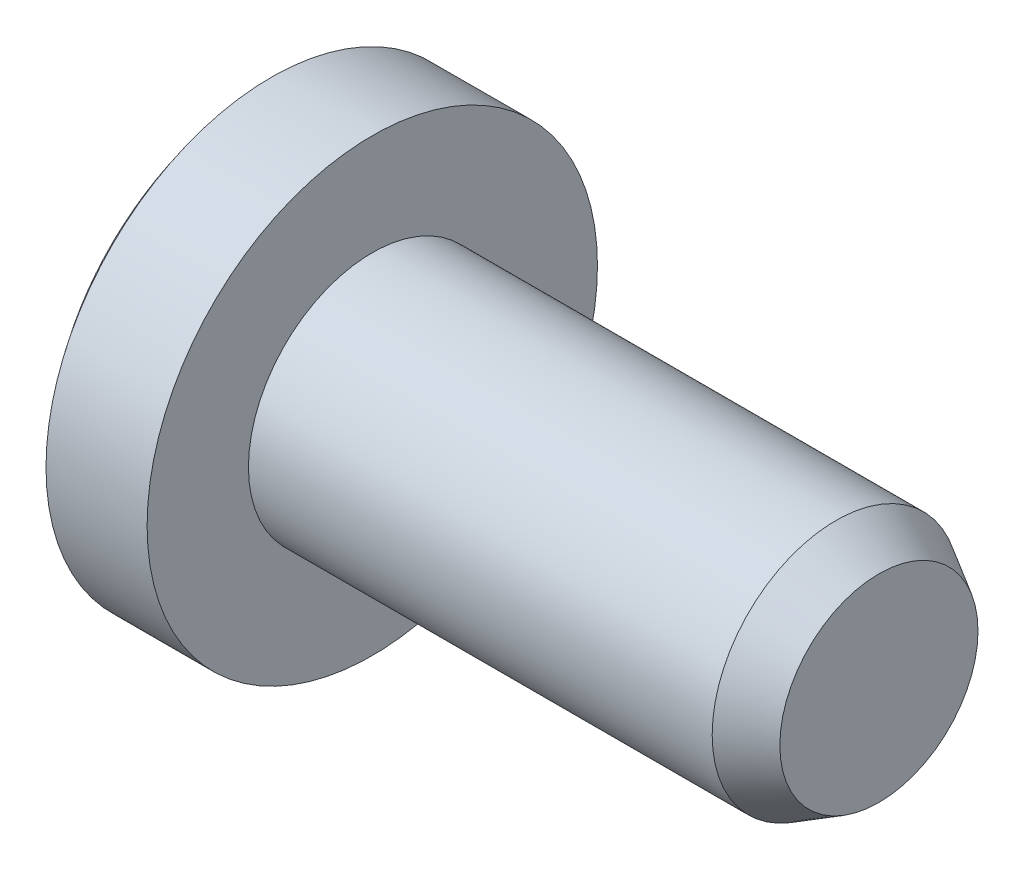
ISO-10303-21;
HEADER;
FILE_DESCRIPTION(('STEP AP214'),'2;1');
FILE_NAME('part.step','',(''),(''),'','','');
FILE_SCHEMA(('AUTOMOTIVE_DESIGN { 1 0 10303 214 1 1 1 1 }'));
ENDSEC;
DATA;
#1=APPLICATION_CONTEXT('core data for automotive mechanical design processes');
#2=APPLICATION_PROTOCOL_DEFINITION('international standard','automotive_design',2000,#1);
#3=PRODUCT_CONTEXT('',#1,'mechanical');
#4=PRODUCT('Part','Part','',(#3));
#5=PRODUCT_RELATED_PRODUCT_CATEGORY('part','',(#4));
#6=PRODUCT_DEFINITION_FORMATION('','',#4);
#7=PRODUCT_DEFINITION_CONTEXT('part definition',#1,'design');
#8=PRODUCT_DEFINITION('design','',#6,#7);
#9=PRODUCT_DEFINITION_SHAPE('','',#8);
#10=(LENGTH_UNIT() NAMED_UNIT(*) SI_UNIT(.MILLI.,.METRE.));
#11=(NAMED_UNIT(*) PLANE_ANGLE_UNIT() SI_UNIT($,.RADIAN.));
#12=(NAMED_UNIT(*) SI_UNIT($,.STERADIAN.) SOLID_ANGLE_UNIT());
#13=UNCERTAINTY_MEASURE_WITH_UNIT(LENGTH_MEASURE(1.E-05),#10,'distance_accuracy_value','');
#14=(GEOMETRIC_REPRESENTATION_CONTEXT(3) GLOBAL_UNCERTAINTY_ASSIGNED_CONTEXT((#13)) GLOBAL_UNIT_ASSIGNED_CONTEXT((#10,
#11,#12)) REPRESENTATION_CONTEXT('',''));
#15=CARTESIAN_POINT('',(0.,0.,0.));
#16=DIRECTION('',(0.,0.,1.));
#17=DIRECTION('',(1.,0.,0.));
#18=AXIS2_PLACEMENT_3D('',#15,#16,#17);
#19=CARTESIAN_POINT('',(1.6,0.,0.));
#20=DIRECTION('',(-1.,0.,0.));
#21=DIRECTION('',(0.,1.,0.));
#22=AXIS2_PLACEMENT_3D('',#19,#20,#21);
#23=SPHERICAL_SURFACE('',#22,3.2);
#24=CARTESIAN_POINT('',(-0.89799919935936,0.,0.));
#25=DIRECTION('',(-1.,0.,0.));
#26=DIRECTION('',(0.,0.,1.));
#27=AXIS2_PLACEMENT_3D('',#24,#25,#26);
#28=CIRCLE('',#27,2.);
#29=CARTESIAN_POINT('',(-0.89799919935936,0.,2.));
#30=VERTEX_POINT('',#29);
#31=EDGE_CURVE('E200',#30,#30,#28,.T.);
#32=ORIENTED_EDGE('',*,*,#31,.T.);
#33=EDGE_LOOP('',(#32));
#34=FACE_BOUND('',#33,.T.);
#35=CARTESIAN_POINT('',(1.56503616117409,0.0806815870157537,0.322726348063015));
#36=DIRECTION('',(0.104528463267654,-0.241206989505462,-0.964827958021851));
#37=DIRECTION('',(0.,0.970142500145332,-0.242535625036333));
#38=AXIS2_PLACEMENT_3D('',#35,#36,#37);
#39=CIRCLE('',#38,3.18247006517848);
#40=CARTESIAN_POINT('',(-1.45274996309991,0.934523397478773,-0.217677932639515));
#41=VERTEX_POINT('',#40);
#42=CARTESIAN_POINT('',(-1.54602165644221,0.569150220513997,-0.136439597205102));
#43=VERTEX_POINT('',#42);
#44=EDGE_CURVE('E11',#41,#43,#39,.F.);
#45=ORIENTED_EDGE('',*,*,#44,.F.);
#46=CARTESIAN_POINT('',(1.66379421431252,0.606961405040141,0.));
#47=DIRECTION('',(0.104528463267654,0.994521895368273,0.));
#48=DIRECTION('',(-0.994521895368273,0.104528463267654,0.));
#49=AXIS2_PLACEMENT_3D('',#46,#47,#48);
#50=CIRCLE('',#49,3.14126219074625);
#51=CARTESIAN_POINT('',(-1.45274996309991,0.934523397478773,0.217677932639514));
#52=VERTEX_POINT('',#51);
#53=EDGE_CURVE('E47',#52,#41,#50,.F.);
#54=ORIENTED_EDGE('',*,*,#53,.F.);
#55=CARTESIAN_POINT('',(1.56503616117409,0.0806815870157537,-0.322726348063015));
#56=DIRECTION('',(0.104528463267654,-0.241206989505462,0.964827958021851));
#57=DIRECTION('',(0.,-0.970142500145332,-0.242535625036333));
#58=AXIS2_PLACEMENT_3D('',#55,#56,#57);
#59=CIRCLE('',#58,3.18247006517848);
#60=CARTESIAN_POINT('',(-1.54602165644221,0.569150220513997,0.136439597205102));
#61=VERTEX_POINT('',#60);
#62=EDGE_CURVE('E331',#61,#52,#59,.F.);
#63=ORIENTED_EDGE('',*,*,#62,.F.);
#64=CARTESIAN_POINT('',(1.60749262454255,0.0356437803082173,0.0617368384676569));
#65=DIRECTION('',(0.104528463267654,0.497260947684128,0.861281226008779));
#66=DIRECTION('',(0.,-0.866025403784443,0.499999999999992));
#67=AXIS2_PLACEMENT_3D('',#64,#65,#66);
#68=CIRCLE('',#67,3.19919707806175);
#69=CARTESIAN_POINT('',(-1.57234339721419,0.296847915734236,0.296847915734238));
#70=VERTEX_POINT('',#69);
#71=EDGE_CURVE('E333',#70,#61,#68,.F.);
#72=ORIENTED_EDGE('',*,*,#71,.F.);
#73=CARTESIAN_POINT('',(1.60749262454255,0.0617368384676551,0.0356437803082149));
#74=DIRECTION('',(0.104528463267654,0.861281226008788,0.497260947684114));
#75=DIRECTION('',(0.,-0.499999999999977,0.866025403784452));
#76=AXIS2_PLACEMENT_3D('',#73,#74,#75);
#77=CIRCLE('',#76,3.19919707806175);
#78=CARTESIAN_POINT('',(-1.54602165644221,0.136439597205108,0.569150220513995));
#79=VERTEX_POINT('',#78);
#80=EDGE_CURVE('E329',#79,#70,#77,.F.);
#81=ORIENTED_EDGE('',*,*,#80,.F.);
#82=CARTESIAN_POINT('',(1.56503616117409,-0.322726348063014,0.0806815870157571));
#83=DIRECTION('',(0.104528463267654,0.964827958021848,-0.241206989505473));
#84=DIRECTION('',(0.,0.242535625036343,0.970142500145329));
#85=AXIS2_PLACEMENT_3D('',#82,#83,#84);
#86=CIRCLE('',#85,3.18247006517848);
#87=CARTESIAN_POINT('',(-1.45274996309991,0.217677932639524,0.934523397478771));
#88=VERTEX_POINT('',#87);
#89=EDGE_CURVE('E330',#88,#79,#86,.F.);
#90=ORIENTED_EDGE('',*,*,#89,.F.);
#91=CARTESIAN_POINT('',(1.66379421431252,0.,0.606961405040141));
#92=DIRECTION('',(0.104528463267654,0.,0.994521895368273));
#93=DIRECTION('',(0.994521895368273,0.,-0.104528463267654));
#94=AXIS2_PLACEMENT_3D('',#91,#92,#93);
#95=CIRCLE('',#94,3.14126219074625);
#96=CARTESIAN_POINT('',(-1.45274996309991,-0.217677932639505,0.934523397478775));
#97=VERTEX_POINT('',#96);
#98=EDGE_CURVE('E324',#97,#88,#95,.F.);
#99=ORIENTED_EDGE('',*,*,#98,.F.);
#100=CARTESIAN_POINT('',(1.56503616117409,0.322726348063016,0.0806815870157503));
#101=DIRECTION('',(0.104528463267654,-0.964827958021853,-0.241206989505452));
#102=DIRECTION('',(0.,0.242535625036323,-0.970142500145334));
#103=AXIS2_PLACEMENT_3D('',#100,#101,#102);
#104=CIRCLE('',#103,3.18247006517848);
#105=CARTESIAN_POINT('',(-1.54602165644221,-0.136439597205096,0.569150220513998));
#106=VERTEX_POINT('',#105);
#107=EDGE_CURVE('E322',#106,#97,#104,.F.);
#108=ORIENTED_EDGE('',*,*,#107,.F.);
#109=CARTESIAN_POINT('',(1.60749262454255,-0.0617368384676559,0.0356437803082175));
#110=DIRECTION('',(0.104528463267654,-0.861281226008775,0.497260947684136));
#111=DIRECTION('',(0.,-0.499999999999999,-0.866025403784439));
#112=AXIS2_PLACEMENT_3D('',#109,#110,#111);
#113=CIRCLE('',#112,3.19919707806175);
#114=CARTESIAN_POINT('',(-1.57234339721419,-0.296847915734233,0.296847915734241));
#115=VERTEX_POINT('',#114);
#116=EDGE_CURVE('E321',#115,#106,#113,.F.);
#117=ORIENTED_EDGE('',*,*,#116,.F.);
#118=CARTESIAN_POINT('',(1.60749262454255,-0.035643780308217,0.0617368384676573));
#119=DIRECTION('',(0.104528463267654,-0.497260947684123,0.861281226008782));
#120=DIRECTION('',(0.,-0.866025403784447,-0.499999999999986));
#121=AXIS2_PLACEMENT_3D('',#118,#119,#120);
#122=CIRCLE('',#121,3.19919707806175);
#123=CARTESIAN_POINT('',(-1.54602165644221,-0.569150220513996,0.136439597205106));
#124=VERTEX_POINT('',#123);
#125=EDGE_CURVE('E316',#124,#115,#122,.F.);
#126=ORIENTED_EDGE('',*,*,#125,.F.);
#127=CARTESIAN_POINT('',(1.56503616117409,-0.0806815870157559,-0.322726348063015));
#128=DIRECTION('',(0.104528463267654,0.241206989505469,0.964827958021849));
#129=DIRECTION('',(0.,-0.97014250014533,0.242535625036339));
#130=AXIS2_PLACEMENT_3D('',#127,#128,#129);
#131=CIRCLE('',#130,3.18247006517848);
#132=CARTESIAN_POINT('',(-1.45274996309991,-0.934523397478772,0.217677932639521));
#133=VERTEX_POINT('',#132);
#134=EDGE_CURVE('E320',#133,#124,#131,.F.);
#135=ORIENTED_EDGE('',*,*,#134,.F.);
#136=CARTESIAN_POINT('',(1.66379421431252,-0.606961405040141,0.));
#137=DIRECTION('',(0.104528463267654,-0.994521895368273,0.));
#138=DIRECTION('',(0.994521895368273,0.104528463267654,0.));
#139=AXIS2_PLACEMENT_3D('',#136,#137,#138);
#140=CIRCLE('',#139,3.14126219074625);
#141=CARTESIAN_POINT('',(-1.45274996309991,-0.934523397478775,-0.217677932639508));
#142=VERTEX_POINT('',#141);
#143=EDGE_CURVE('E314',#142,#133,#140,.F.);
#144=ORIENTED_EDGE('',*,*,#143,.F.);
#145=CARTESIAN_POINT('',(1.56503616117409,-0.0806815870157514,0.322726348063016));
#146=DIRECTION('',(0.104528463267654,0.241206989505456,-0.964827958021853));
#147=DIRECTION('',(0.,0.970142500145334,0.242535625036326));
#148=AXIS2_PLACEMENT_3D('',#145,#146,#147);
#149=CIRCLE('',#148,3.18247006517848);
#150=CARTESIAN_POINT('',(-1.54602165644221,-0.569150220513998,-0.136439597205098));
#151=VERTEX_POINT('',#150);
#152=EDGE_CURVE('E312',#151,#142,#149,.F.);
#153=ORIENTED_EDGE('',*,*,#152,.F.);
#154=CARTESIAN_POINT('',(1.60749262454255,-0.0356437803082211,-0.0617368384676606));
#155=DIRECTION('',(0.104528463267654,-0.497260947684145,-0.861281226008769));
#156=DIRECTION('',(0.,0.866025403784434,-0.500000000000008));
#157=AXIS2_PLACEMENT_3D('',#154,#155,#156);
#158=CIRCLE('',#157,3.19919707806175);
#159=CARTESIAN_POINT('',(-1.57234339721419,-0.296847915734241,-0.296847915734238));
#160=VERTEX_POINT('',#159);
#161=EDGE_CURVE('E311',#160,#151,#158,.F.);
#162=ORIENTED_EDGE('',*,*,#161,.F.);
#163=CARTESIAN_POINT('',(1.60749262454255,-0.061736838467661,-0.0356437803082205));
#164=DIRECTION('',(0.104528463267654,-0.861281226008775,-0.497260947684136));
#165=DIRECTION('',(0.,0.499999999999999,-0.866025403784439));
#166=AXIS2_PLACEMENT_3D('',#163,#164,#165);
#167=CIRCLE('',#166,3.19919707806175);
#168=CARTESIAN_POINT('',(-1.54602165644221,-0.136439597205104,-0.569150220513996));
#169=VERTEX_POINT('',#168);
#170=EDGE_CURVE('E307',#169,#160,#167,.F.);
#171=ORIENTED_EDGE('',*,*,#170,.F.);
#172=CARTESIAN_POINT('',(1.56503616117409,0.322726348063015,-0.0806815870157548));
#173=DIRECTION('',(0.104528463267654,-0.96482795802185,0.241206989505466));
#174=DIRECTION('',(0.,-0.242535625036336,-0.970142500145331));
#175=AXIS2_PLACEMENT_3D('',#172,#173,#174);
#176=CIRCLE('',#175,3.18247006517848);
#177=CARTESIAN_POINT('',(-1.45274996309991,-0.217677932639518,-0.934523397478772));
#178=VERTEX_POINT('',#177);
#179=EDGE_CURVE('E310',#178,#169,#176,.F.);
#180=ORIENTED_EDGE('',*,*,#179,.F.);
#181=CARTESIAN_POINT('',(1.66379421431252,0.,-0.606961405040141));
#182=DIRECTION('',(0.104528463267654,0.,-0.994521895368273));
#183=DIRECTION('',(-0.994521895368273,0.,-0.104528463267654));
#184=AXIS2_PLACEMENT_3D('',#181,#182,#183);
#185=CIRCLE('',#184,3.14126219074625);
#186=CARTESIAN_POINT('',(-1.45274996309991,0.217677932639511,-0.934523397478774));
#187=VERTEX_POINT('',#186);
#188=EDGE_CURVE('E304',#187,#178,#185,.F.);
#189=ORIENTED_EDGE('',*,*,#188,.F.);
#190=CARTESIAN_POINT('',(1.56503616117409,-0.322726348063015,-0.0806815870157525));
#191=DIRECTION('',(0.104528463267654,0.964827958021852,0.241206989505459));
#192=DIRECTION('',(0.,-0.242535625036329,0.970142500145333));
#193=AXIS2_PLACEMENT_3D('',#190,#191,#192);
#194=CIRCLE('',#193,3.18247006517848);
#195=CARTESIAN_POINT('',(-1.54602165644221,0.1364395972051,-0.569150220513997));
#196=VERTEX_POINT('',#195);
#197=EDGE_CURVE('E303',#196,#187,#194,.F.);
#198=ORIENTED_EDGE('',*,*,#197,.F.);
#199=CARTESIAN_POINT('',(1.60749262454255,0.0617368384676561,-0.035643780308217));
#200=DIRECTION('',(0.104528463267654,0.861281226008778,-0.497260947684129));
#201=DIRECTION('',(0.,0.499999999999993,0.866025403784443));
#202=AXIS2_PLACEMENT_3D('',#199,#200,#201);
#203=CIRCLE('',#202,3.19919707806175);
#204=CARTESIAN_POINT('',(-1.57234339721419,0.296847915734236,-0.296847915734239));
#205=VERTEX_POINT('',#204);
#206=EDGE_CURVE('E301',#205,#196,#203,.F.);
#207=ORIENTED_EDGE('',*,*,#206,.F.);
#208=CARTESIAN_POINT('',(1.60749262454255,0.0356437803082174,-0.061736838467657));
#209=DIRECTION('',(0.104528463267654,0.497260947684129,-0.861281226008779));
#210=DIRECTION('',(0.,0.866025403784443,0.499999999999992));
#211=AXIS2_PLACEMENT_3D('',#208,#209,#210);
#212=CIRCLE('',#211,3.19919707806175);
#213=EDGE_CURVE('E299',#43,#205,#212,.F.);
#214=ORIENTED_EDGE('',*,*,#213,.F.);
#215=EDGE_LOOP('',(#45,#54,#63,#72,#81,#90,#99,#108,#117,#126,#135,#144,#153,#162,#171,#180,
#189,#198,#207,#214));
#216=FACE_BOUND('',#215,.T.);
#217=ADVANCED_FACE('F41',(#34,#216),#23,.T.);
#218=CARTESIAN_POINT('',(0.,1.1,0.));
#219=DIRECTION('',(-1.,0.,0.));
#220=DIRECTION('',(0.,0.,1.));
#221=AXIS2_PLACEMENT_3D('',#218,#219,#220);
#222=PLANE('',#221);
#223=CARTESIAN_POINT('',(0.,0.,0.));
#224=DIRECTION('',(-1.,0.,0.));
#225=DIRECTION('',(0.,0.,1.));
#226=AXIS2_PLACEMENT_3D('',#223,#224,#225);
#227=CIRCLE('',#226,2.);
#228=CARTESIAN_POINT('',(0.,0.,2.));
#229=VERTEX_POINT('',#228);
#230=EDGE_CURVE('E289',#229,#229,#227,.T.);
#231=ORIENTED_EDGE('',*,*,#230,.F.);
#232=EDGE_LOOP('',(#231));
#233=FACE_BOUND('',#232,.T.);
#234=CARTESIAN_POINT('',(0.,0.,0.));
#235=DIRECTION('',(-1.,0.,0.));
#236=DIRECTION('',(0.,0.,1.));
#237=AXIS2_PLACEMENT_3D('',#234,#235,#236);
#238=CIRCLE('',#237,1.1);
#239=CARTESIAN_POINT('',(0.,0.,1.1));
#240=VERTEX_POINT('',#239);
#241=EDGE_CURVE('E192',#240,#240,#238,.T.);
#242=ORIENTED_EDGE('',*,*,#241,.T.);
#243=EDGE_LOOP('',(#242));
#244=FACE_BOUND('',#243,.T.);
#245=ADVANCED_FACE('F429',(#233,#244),#222,.F.);
#246=CARTESIAN_POINT('',(0.,0.,0.));
#247=DIRECTION('',(-1.,0.,0.));
#248=DIRECTION('',(0.,0.,1.));
#249=AXIS2_PLACEMENT_3D('',#246,#247,#248);
#250=CYLINDRICAL_SURFACE('',#249,2.);
#251=ORIENTED_EDGE('',*,*,#31,.F.);
#252=EDGE_LOOP('',(#251));
#253=FACE_BOUND('',#252,.T.);
#254=ORIENTED_EDGE('',*,*,#230,.T.);
#255=EDGE_LOOP('',(#254));
#256=FACE_BOUND('',#255,.T.);
#257=ADVANCED_FACE('F440',(#253,#256),#250,.T.);
#258=CARTESIAN_POINT('',(4.5,1.1,0.));
#259=DIRECTION('',(-1.,0.,0.));
#260=DIRECTION('',(0.,0.,1.));
#261=AXIS2_PLACEMENT_3D('',#258,#259,#260);
#262=PLANE('',#261);
#263=CARTESIAN_POINT('',(4.5,0.,0.));
#264=DIRECTION('',(-1.,0.,0.));
#265=DIRECTION('',(0.,0.,1.));
#266=AXIS2_PLACEMENT_3D('',#263,#264,#265);
#267=CIRCLE('',#266,0.88);
#268=CARTESIAN_POINT('',(4.5,0.,0.88));
#269=VERTEX_POINT('',#268);
#270=EDGE_CURVE('E298',#269,#269,#267,.F.);
#271=ORIENTED_EDGE('',*,*,#270,.T.);
#272=EDGE_LOOP('',(#271));
#273=FACE_BOUND('',#272,.T.);
#274=ADVANCED_FACE('F441',(#273),#262,.F.);
#275=CARTESIAN_POINT('',(0.,0.,0.));
#276=DIRECTION('',(-1.,0.,0.));
#277=DIRECTION('',(0.,0.,1.));
#278=AXIS2_PLACEMENT_3D('',#275,#276,#277);
#279=CYLINDRICAL_SURFACE('',#278,1.1);
#280=CARTESIAN_POINT('',(4.11894882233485,0.,0.));
#281=DIRECTION('',(-1.,0.,0.));
#282=DIRECTION('',(0.,0.,1.));
#283=AXIS2_PLACEMENT_3D('',#280,#281,#282);
#284=CIRCLE('',#283,1.1);
#285=CARTESIAN_POINT('',(4.11894882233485,0.,1.1));
#286=VERTEX_POINT('',#285);
#287=EDGE_CURVE('E291',#286,#286,#284,.T.);
#288=ORIENTED_EDGE('',*,*,#287,.T.);
#289=EDGE_LOOP('',(#288));
#290=FACE_BOUND('',#289,.T.);
#291=ORIENTED_EDGE('',*,*,#241,.F.);
#292=EDGE_LOOP('',(#291));
#293=FACE_BOUND('',#292,.T.);
#294=ADVANCED_FACE('F449',(#290,#293),#279,.T.);
#295=CARTESIAN_POINT('',(4.11894882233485,0.,0.));
#296=DIRECTION('',(-1.,0.,0.));
#297=DIRECTION('',(0.,0.,1.));
#298=AXIS2_PLACEMENT_3D('',#295,#296,#297);
#299=CONICAL_SURFACE('',#298,1.1,0.523598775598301);
#300=ORIENTED_EDGE('',*,*,#270,.F.);
#301=EDGE_LOOP('',(#300));
#302=FACE_BOUND('',#301,.T.);
#303=ORIENTED_EDGE('',*,*,#287,.F.);
#304=EDGE_LOOP('',(#303));
#305=FACE_BOUND('',#304,.T.);
#306=ADVANCED_FACE('F43',(#302,#305),#299,.T.);
#307=CARTESIAN_POINT('',(-1.6,0.95,-0.2375));
#308=DIRECTION('',(0.104528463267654,-0.241206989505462,-0.964827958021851));
#309=DIRECTION('',(0.,0.970142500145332,-0.242535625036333));
#310=AXIS2_PLACEMENT_3D('',#307,#308,#309);
#311=PLANE('',#310);
#312=ORIENTED_EDGE('',*,*,#44,.T.);
#313=DIRECTION('',(-0.993634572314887,0.0156427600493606,-0.111560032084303));
#314=VECTOR('',#313,1.);
#315=CARTESIAN_POINT('',(-1.6,0.57,-0.1425));
#316=LINE('',#315,#314);
#317=CARTESIAN_POINT('',(-0.8,0.557405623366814,-0.052680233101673));
#318=VERTEX_POINT('',#317);
#319=EDGE_CURVE('E57',#318,#43,#316,.T.);
#320=ORIENTED_EDGE('',*,*,#319,.F.);
#321=DIRECTION('',(0.,-0.970142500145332,0.242535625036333));
#322=VECTOR('',#321,1.);
#323=CARTESIAN_POINT('',(-0.8,0.0203932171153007,0.081572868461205));
#324=LINE('',#323,#322);
#325=CARTESIAN_POINT('',(-0.8,0.865916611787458,-0.129807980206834));
#326=VERTEX_POINT('',#325);
#327=EDGE_CURVE('E185',#318,#326,#324,.F.);
#328=ORIENTED_EDGE('',*,*,#327,.T.);
#329=DIRECTION('',(-0.985727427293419,0.103604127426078,-0.132693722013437));
#330=VECTOR('',#329,1.);
#331=CARTESIAN_POINT('',(-1.53787007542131,0.943469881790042,-0.229136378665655));
#332=LINE('',#331,#330);
#333=EDGE_CURVE('E186',#326,#41,#332,.T.);
#334=ORIENTED_EDGE('',*,*,#333,.T.);
#335=EDGE_LOOP('',(#312,#320,#328,#334));
#336=FACE_BOUND('',#335,.T.);
#337=ADVANCED_FACE('F189',(#336),#311,.F.);
#338=CARTESIAN_POINT('',(-1.6,0.95,0.2375));
#339=DIRECTION('',(0.104528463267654,0.994521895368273,0.));
#340=DIRECTION('',(-0.994521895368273,0.104528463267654,0.));
#341=AXIS2_PLACEMENT_3D('',#338,#339,#340);
#342=PLANE('',#341);
#343=ORIENTED_EDGE('',*,*,#53,.T.);
#344=ORIENTED_EDGE('',*,*,#333,.F.);
#345=DIRECTION('',(0.,0.,-1.));
#346=VECTOR('',#345,1.);
#347=CARTESIAN_POINT('',(-0.8,0.865916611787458,0.));
#348=LINE('',#347,#346);
#349=CARTESIAN_POINT('',(-0.8,0.865916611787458,0.129807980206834));
#350=VERTEX_POINT('',#349);
#351=EDGE_CURVE('E178',#326,#350,#348,.F.);
#352=ORIENTED_EDGE('',*,*,#351,.T.);
#353=DIRECTION('',(-0.985727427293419,0.103604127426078,0.132693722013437));
#354=VECTOR('',#353,1.);
#355=CARTESIAN_POINT('',(-1.6,0.95,0.2375));
#356=LINE('',#355,#354);
#357=EDGE_CURVE('E193',#350,#52,#356,.T.);
#358=ORIENTED_EDGE('',*,*,#357,.T.);
#359=EDGE_LOOP('',(#343,#344,#352,#358));
#360=FACE_BOUND('',#359,.T.);
#361=ADVANCED_FACE('F195',(#360),#342,.F.);
#362=CARTESIAN_POINT('',(-1.6,0.95,0.2375));
#363=DIRECTION('',(0.104528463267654,-0.241206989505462,0.964827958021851));
#364=DIRECTION('',(0.,-0.970142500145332,-0.242535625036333));
#365=AXIS2_PLACEMENT_3D('',#362,#363,#364);
#366=PLANE('',#365);
#367=ORIENTED_EDGE('',*,*,#62,.T.);
#368=ORIENTED_EDGE('',*,*,#357,.F.);
#369=DIRECTION('',(0.,0.970142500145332,0.242535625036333));
#370=VECTOR('',#369,1.);
#371=CARTESIAN_POINT('',(-0.8,0.0203932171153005,-0.0815728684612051));
#372=LINE('',#371,#370);
#373=CARTESIAN_POINT('',(-0.8,0.557405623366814,0.052680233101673));
#374=VERTEX_POINT('',#373);
#375=EDGE_CURVE('E183',#350,#374,#372,.F.);
#376=ORIENTED_EDGE('',*,*,#375,.T.);
#377=DIRECTION('',(-0.993634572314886,0.0156427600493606,0.111560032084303));
#378=VECTOR('',#377,1.);
#379=CARTESIAN_POINT('',(-1.61643715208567,0.57025876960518,0.14434547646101));
#380=LINE('',#379,#378);
#381=EDGE_CURVE('E199',#374,#61,#380,.T.);
#382=ORIENTED_EDGE('',*,*,#381,.T.);
#383=EDGE_LOOP('',(#367,#368,#376,#382));
#384=FACE_BOUND('',#383,.T.);
#385=ADVANCED_FACE('F337',(#384),#366,.F.);
#386=CARTESIAN_POINT('',(-1.6,0.57,0.1425));
#387=DIRECTION('',(0.104528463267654,0.497260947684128,0.861281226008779));
#388=DIRECTION('',(0.,-0.866025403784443,0.499999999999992));
#389=AXIS2_PLACEMENT_3D('',#386,#387,#388);
#390=PLANE('',#389);
#391=ORIENTED_EDGE('',*,*,#71,.T.);
#392=ORIENTED_EDGE('',*,*,#381,.F.);
#393=DIRECTION('',(0.,0.866025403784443,-0.499999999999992));
#394=VECTOR('',#393,1.);
#395=CARTESIAN_POINT('',(-0.8,0.162162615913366,0.280873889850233));
#396=LINE('',#395,#394);
#397=CARTESIAN_POINT('',(-0.8,0.237422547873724,0.237422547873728));
#398=VERTEX_POINT('',#397);
#399=EDGE_CURVE('E253',#374,#398,#396,.F.);
#400=ORIENTED_EDGE('',*,*,#399,.T.);
#401=DIRECTION('',(-0.994132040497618,0.0764901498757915,0.0764901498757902));
#402=VECTOR('',#401,1.);
#403=CARTESIAN_POINT('',(-1.60871040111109,0.299646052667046,0.299646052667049));
#404=LINE('',#403,#402);
#405=EDGE_CURVE('E248',#398,#70,#404,.T.);
#406=ORIENTED_EDGE('',*,*,#405,.T.);
#407=EDGE_LOOP('',(#391,#392,#400,#406));
#408=FACE_BOUND('',#407,.T.);
#409=ADVANCED_FACE('F417',(#408),#390,.F.);
#410=CARTESIAN_POINT('',(-1.6,0.142500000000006,0.569999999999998));
#411=DIRECTION('',(0.104528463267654,0.861281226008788,0.497260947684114));
#412=DIRECTION('',(0.,-0.499999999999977,0.866025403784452));
#413=AXIS2_PLACEMENT_3D('',#410,#411,#412);
#414=PLANE('',#413);
#415=ORIENTED_EDGE('',*,*,#80,.T.);
#416=ORIENTED_EDGE('',*,*,#405,.F.);
#417=DIRECTION('',(0.,0.499999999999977,-0.866025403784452));
#418=VECTOR('',#417,1.);
#419=CARTESIAN_POINT('',(-0.8,0.280873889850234,0.162162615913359));
#420=LINE('',#419,#418);
#421=CARTESIAN_POINT('',(-0.8,0.0526802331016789,0.557405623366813));
#422=VERTEX_POINT('',#421);
#423=EDGE_CURVE('E260',#398,#422,#420,.F.);
#424=ORIENTED_EDGE('',*,*,#423,.T.);
#425=DIRECTION('',(-0.993634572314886,0.111560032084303,0.0156427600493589));
#426=VECTOR('',#425,1.);
#427=CARTESIAN_POINT('',(-1.6,0.142500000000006,0.569999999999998));
#428=LINE('',#427,#426);
#429=EDGE_CURVE('E246',#422,#79,#428,.T.);
#430=ORIENTED_EDGE('',*,*,#429,.T.);
#431=EDGE_LOOP('',(#415,#416,#424,#430));
#432=FACE_BOUND('',#431,.T.);
#433=ADVANCED_FACE('F418',(#432),#414,.F.);
#434=CARTESIAN_POINT('',(-1.6,0.23750000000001,0.949999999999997));
#435=DIRECTION('',(0.104528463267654,0.964827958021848,-0.241206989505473));
#436=DIRECTION('',(0.,0.242535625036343,0.970142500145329));
#437=AXIS2_PLACEMENT_3D('',#434,#435,#436);
#438=PLANE('',#437);
#439=ORIENTED_EDGE('',*,*,#89,.T.);
#440=ORIENTED_EDGE('',*,*,#429,.F.);
#441=DIRECTION('',(0.,-0.242535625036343,-0.970142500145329));
#442=VECTOR('',#441,1.);
#443=CARTESIAN_POINT('',(-0.8,-0.0815728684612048,0.0203932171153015));
#444=LINE('',#443,#442);
#445=CARTESIAN_POINT('',(-0.8,0.129807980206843,0.865916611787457));
#446=VERTEX_POINT('',#445);
#447=EDGE_CURVE('E258',#422,#446,#444,.F.);
#448=ORIENTED_EDGE('',*,*,#447,.T.);
#449=DIRECTION('',(-0.985727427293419,0.132693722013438,0.103604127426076));
#450=VECTOR('',#449,1.);
#451=CARTESIAN_POINT('',(-1.53787007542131,0.229136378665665,0.94346988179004));
#452=LINE('',#451,#450);
#453=EDGE_CURVE('E243',#446,#88,#452,.T.);
#454=ORIENTED_EDGE('',*,*,#453,.T.);
#455=EDGE_LOOP('',(#439,#440,#448,#454));
#456=FACE_BOUND('',#455,.T.);
#457=ADVANCED_FACE('F413',(#456),#438,.F.);
#458=CARTESIAN_POINT('',(-1.6,-0.23749999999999,0.950000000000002));
#459=DIRECTION('',(0.104528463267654,0.,0.994521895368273));
#460=DIRECTION('',(0.994521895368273,0.,-0.104528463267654));
#461=AXIS2_PLACEMENT_3D('',#458,#459,#460);
#462=PLANE('',#461);
#463=ORIENTED_EDGE('',*,*,#98,.T.);
#464=ORIENTED_EDGE('',*,*,#453,.F.);
#465=DIRECTION('',(0.,1.,0.));
#466=VECTOR('',#465,1.);
#467=CARTESIAN_POINT('',(-0.8,0.,0.865916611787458));
#468=LINE('',#467,#466);
#469=CARTESIAN_POINT('',(-0.8,-0.129807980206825,0.86591661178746));
#470=VERTEX_POINT('',#469);
#471=EDGE_CURVE('E262',#446,#470,#468,.F.);
#472=ORIENTED_EDGE('',*,*,#471,.T.);
#473=DIRECTION('',(-0.985727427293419,-0.132693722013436,0.103604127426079));
#474=VECTOR('',#473,1.);
#475=CARTESIAN_POINT('',(-1.6,-0.23749999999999,0.950000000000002));
#476=LINE('',#475,#474);
#477=EDGE_CURVE('E239',#470,#97,#476,.T.);
#478=ORIENTED_EDGE('',*,*,#477,.T.);
#479=EDGE_LOOP('',(#463,#464,#472,#478));
#480=FACE_BOUND('',#479,.T.);
#481=ADVANCED_FACE('F406',(#480),#462,.F.);
#482=CARTESIAN_POINT('',(-1.6,-0.23749999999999,0.950000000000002));
#483=DIRECTION('',(0.104528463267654,-0.964827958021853,-0.241206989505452));
#484=DIRECTION('',(0.,0.242535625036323,-0.970142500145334));
#485=AXIS2_PLACEMENT_3D('',#482,#483,#484);
#486=PLANE('',#485);
#487=ORIENTED_EDGE('',*,*,#107,.T.);
#488=ORIENTED_EDGE('',*,*,#477,.F.);
#489=DIRECTION('',(0.,-0.242535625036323,0.970142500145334));
#490=VECTOR('',#489,1.);
#491=CARTESIAN_POINT('',(-0.8,0.0815728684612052,0.0203932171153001));
#492=LINE('',#491,#490);
#493=CARTESIAN_POINT('',(-0.8,-0.0526802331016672,0.557405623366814));
#494=VERTEX_POINT('',#493);
#495=EDGE_CURVE('E263',#470,#494,#492,.F.);
#496=ORIENTED_EDGE('',*,*,#495,.T.);
#497=DIRECTION('',(-0.993634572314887,-0.111560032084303,0.0156427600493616));
#498=VECTOR('',#497,1.);
#499=CARTESIAN_POINT('',(-1.61643715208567,-0.144345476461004,0.570258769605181));
#500=LINE('',#499,#498);
#501=EDGE_CURVE('E240',#494,#106,#500,.T.);
#502=ORIENTED_EDGE('',*,*,#501,.T.);
#503=EDGE_LOOP('',(#487,#488,#496,#502));
#504=FACE_BOUND('',#503,.T.);
#505=ADVANCED_FACE('F404',(#504),#486,.F.);
#506=CARTESIAN_POINT('',(-1.6,-0.142499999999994,0.570000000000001));
#507=DIRECTION('',(0.104528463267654,-0.861281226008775,0.497260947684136));
#508=DIRECTION('',(0.,-0.499999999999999,-0.866025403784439));
#509=AXIS2_PLACEMENT_3D('',#506,#507,#508);
#510=PLANE('',#509);
#511=ORIENTED_EDGE('',*,*,#116,.T.);
#512=ORIENTED_EDGE('',*,*,#501,.F.);
#513=DIRECTION('',(0.,0.499999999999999,0.866025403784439));
#514=VECTOR('',#513,1.);
#515=CARTESIAN_POINT('',(-0.8,-0.280873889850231,0.162162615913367));
#516=LINE('',#515,#514);
#517=CARTESIAN_POINT('',(-0.8,-0.237422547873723,0.23742254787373));
#518=VERTEX_POINT('',#517);
#519=EDGE_CURVE('E261',#494,#518,#516,.F.);
#520=ORIENTED_EDGE('',*,*,#519,.T.);
#521=DIRECTION('',(-0.994132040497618,-0.07649014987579,0.0764901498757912));
#522=VECTOR('',#521,1.);
#523=CARTESIAN_POINT('',(-1.60871040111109,-0.299646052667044,0.299646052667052));
#524=LINE('',#523,#522);
#525=EDGE_CURVE('E234',#518,#115,#524,.T.);
#526=ORIENTED_EDGE('',*,*,#525,.T.);
#527=EDGE_LOOP('',(#511,#512,#520,#526));
#528=FACE_BOUND('',#527,.T.);
#529=ADVANCED_FACE('F400',(#528),#510,.F.);
#530=CARTESIAN_POINT('',(-1.6,-0.569999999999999,0.142500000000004));
#531=DIRECTION('',(0.104528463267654,-0.497260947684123,0.861281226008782));
#532=DIRECTION('',(0.,-0.866025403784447,-0.499999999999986));
#533=AXIS2_PLACEMENT_3D('',#530,#531,#532);
#534=PLANE('',#533);
#535=ORIENTED_EDGE('',*,*,#125,.T.);
#536=ORIENTED_EDGE('',*,*,#525,.F.);
#537=DIRECTION('',(0.,0.866025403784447,0.499999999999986));
#538=VECTOR('',#537,1.);
#539=CARTESIAN_POINT('',(-0.8,-0.162162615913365,0.280873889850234));
#540=LINE('',#539,#538);
#541=CARTESIAN_POINT('',(-0.8,-0.557405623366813,0.0526802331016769));
#542=VERTEX_POINT('',#541);
#543=EDGE_CURVE('E270',#518,#542,#540,.F.);
#544=ORIENTED_EDGE('',*,*,#543,.T.);
#545=DIRECTION('',(-0.993634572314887,-0.0156427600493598,0.111560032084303));
#546=VECTOR('',#545,1.);
#547=CARTESIAN_POINT('',(-1.6,-0.569999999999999,0.142500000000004));
#548=LINE('',#547,#546);
#549=EDGE_CURVE('E233',#542,#124,#548,.T.);
#550=ORIENTED_EDGE('',*,*,#549,.T.);
#551=EDGE_LOOP('',(#535,#536,#544,#550));
#552=FACE_BOUND('',#551,.T.);
#553=ADVANCED_FACE('F394',(#552),#534,.F.);
#554=CARTESIAN_POINT('',(-1.6,-0.949999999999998,0.237500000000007));
#555=DIRECTION('',(0.104528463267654,0.241206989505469,0.964827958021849));
#556=DIRECTION('',(0.,-0.97014250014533,0.242535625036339));
#557=AXIS2_PLACEMENT_3D('',#554,#555,#556);
#558=PLANE('',#557);
#559=ORIENTED_EDGE('',*,*,#134,.T.);
#560=ORIENTED_EDGE('',*,*,#549,.F.);
#561=DIRECTION('',(0.,0.97014250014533,-0.242535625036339));
#562=VECTOR('',#561,1.);
#563=CARTESIAN_POINT('',(-0.8,-0.0203932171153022,-0.0815728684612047));
#564=LINE('',#563,#562);
#565=CARTESIAN_POINT('',(-0.8,-0.865916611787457,0.12980798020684));
#566=VERTEX_POINT('',#565);
#567=EDGE_CURVE('E267',#542,#566,#564,.F.);
#568=ORIENTED_EDGE('',*,*,#567,.T.);
#569=DIRECTION('',(-0.985727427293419,-0.103604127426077,0.132693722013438));
#570=VECTOR('',#569,1.);
#571=CARTESIAN_POINT('',(-1.53787007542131,-0.943469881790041,0.229136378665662));
#572=LINE('',#571,#570);
#573=EDGE_CURVE('E226',#566,#133,#572,.T.);
#574=ORIENTED_EDGE('',*,*,#573,.T.);
#575=EDGE_LOOP('',(#559,#560,#568,#574));
#576=FACE_BOUND('',#575,.T.);
#577=ADVANCED_FACE('F386',(#576),#558,.F.);
#578=CARTESIAN_POINT('',(-1.6,-0.950000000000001,-0.237499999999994));
#579=DIRECTION('',(0.104528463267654,-0.994521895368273,0.));
#580=DIRECTION('',(0.994521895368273,0.104528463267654,0.));
#581=AXIS2_PLACEMENT_3D('',#578,#579,#580);
#582=PLANE('',#581);
#583=ORIENTED_EDGE('',*,*,#143,.T.);
#584=ORIENTED_EDGE('',*,*,#573,.F.);
#585=DIRECTION('',(0.,0.,1.));
#586=VECTOR('',#585,1.);
#587=CARTESIAN_POINT('',(-0.8,-0.865916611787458,0.));
#588=LINE('',#587,#586);
#589=CARTESIAN_POINT('',(-0.8,-0.865916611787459,-0.129807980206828));
#590=VERTEX_POINT('',#589);
#591=EDGE_CURVE('E272',#566,#590,#588,.F.);
#592=ORIENTED_EDGE('',*,*,#591,.T.);
#593=DIRECTION('',(-0.985727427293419,-0.103604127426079,-0.132693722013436));
#594=VECTOR('',#593,1.);
#595=CARTESIAN_POINT('',(-1.6,-0.950000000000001,-0.237499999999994));
#596=LINE('',#595,#594);
#597=EDGE_CURVE('E224',#590,#142,#596,.T.);
#598=ORIENTED_EDGE('',*,*,#597,.T.);
#599=EDGE_LOOP('',(#583,#584,#592,#598));
#600=FACE_BOUND('',#599,.T.);
#601=ADVANCED_FACE('F381',(#600),#582,.F.);
#602=CARTESIAN_POINT('',(-1.6,-0.950000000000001,-0.237499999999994));
#603=DIRECTION('',(0.104528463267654,0.241206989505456,-0.964827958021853));
#604=DIRECTION('',(0.,0.970142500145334,0.242535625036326));
#605=AXIS2_PLACEMENT_3D('',#602,#603,#604);
#606=PLANE('',#605);
#607=ORIENTED_EDGE('',*,*,#152,.T.);
#608=ORIENTED_EDGE('',*,*,#597,.F.);
#609=DIRECTION('',(0.,-0.970142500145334,-0.242535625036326));
#610=VECTOR('',#609,1.);
#611=CARTESIAN_POINT('',(-0.8,-0.0203932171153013,0.0815728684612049));
#612=LINE('',#611,#610);
#613=CARTESIAN_POINT('',(-0.8,-0.557405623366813,-0.052680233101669));
#614=VERTEX_POINT('',#613);
#615=EDGE_CURVE('E271',#590,#614,#612,.F.);
#616=ORIENTED_EDGE('',*,*,#615,.T.);
#617=DIRECTION('',(-0.993634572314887,-0.015642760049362,-0.111560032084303));
#618=VECTOR('',#617,1.);
#619=CARTESIAN_POINT('',(-1.61643715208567,-0.570258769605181,-0.144345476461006));
#620=LINE('',#619,#618);
#621=EDGE_CURVE('E225',#614,#151,#620,.T.);
#622=ORIENTED_EDGE('',*,*,#621,.T.);
#623=EDGE_LOOP('',(#607,#608,#616,#622));
#624=FACE_BOUND('',#623,.T.);
#625=ADVANCED_FACE('F380',(#624),#606,.F.);
#626=CARTESIAN_POINT('',(-1.6,-0.570000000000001,-0.142499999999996));
#627=DIRECTION('',(0.104528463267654,-0.497260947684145,-0.861281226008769));
#628=DIRECTION('',(0.,0.866025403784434,-0.500000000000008));
#629=AXIS2_PLACEMENT_3D('',#626,#627,#628);
#630=PLANE('',#629);
#631=ORIENTED_EDGE('',*,*,#161,.T.);
#632=ORIENTED_EDGE('',*,*,#621,.F.);
#633=DIRECTION('',(0.,-0.866025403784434,0.500000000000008));
#634=VECTOR('',#633,1.);
#635=CARTESIAN_POINT('',(-0.8,-0.162162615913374,-0.280873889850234));
#636=LINE('',#635,#634);
#637=CARTESIAN_POINT('',(-0.8,-0.237422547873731,-0.237422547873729));
#638=VERTEX_POINT('',#637);
#639=EDGE_CURVE('E273',#614,#638,#636,.F.);
#640=ORIENTED_EDGE('',*,*,#639,.T.);
#641=DIRECTION('',(-0.994132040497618,-0.0764901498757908,-0.07649014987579));
#642=VECTOR('',#641,1.);
#643=CARTESIAN_POINT('',(-1.60871040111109,-0.299646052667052,-0.299646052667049));
#644=LINE('',#643,#642);
#645=EDGE_CURVE('E219',#638,#160,#644,.T.);
#646=ORIENTED_EDGE('',*,*,#645,.T.);
#647=EDGE_LOOP('',(#631,#632,#640,#646));
#648=FACE_BOUND('',#647,.T.);
#649=ADVANCED_FACE('F372',(#648),#630,.F.);
#650=CARTESIAN_POINT('',(-1.6,-0.142500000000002,-0.569999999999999));
#651=DIRECTION('',(0.104528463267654,-0.861281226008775,-0.497260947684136));
#652=DIRECTION('',(0.,0.499999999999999,-0.866025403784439));
#653=AXIS2_PLACEMENT_3D('',#650,#651,#652);
#654=PLANE('',#653);
#655=ORIENTED_EDGE('',*,*,#170,.T.);
#656=ORIENTED_EDGE('',*,*,#645,.F.);
#657=DIRECTION('',(0.,-0.499999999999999,0.866025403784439));
#658=VECTOR('',#657,1.);
#659=CARTESIAN_POINT('',(-0.8,-0.280873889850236,-0.162162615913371));
#660=LINE('',#659,#658);
#661=CARTESIAN_POINT('',(-0.8,-0.0526802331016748,-0.557405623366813));
#662=VERTEX_POINT('',#661);
#663=EDGE_CURVE('E280',#638,#662,#660,.F.);
#664=ORIENTED_EDGE('',*,*,#663,.T.);
#665=DIRECTION('',(-0.993634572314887,-0.111560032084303,-0.0156427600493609));
#666=VECTOR('',#665,1.);
#667=CARTESIAN_POINT('',(-1.6,-0.142500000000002,-0.569999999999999));
#668=LINE('',#667,#666);
#669=EDGE_CURVE('E217',#662,#169,#668,.T.);
#670=ORIENTED_EDGE('',*,*,#669,.T.);
#671=EDGE_LOOP('',(#655,#656,#664,#670));
#672=FACE_BOUND('',#671,.T.);
#673=ADVANCED_FACE('F366',(#672),#654,.F.);
#674=CARTESIAN_POINT('',(-1.6,-0.237500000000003,-0.949999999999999));
#675=DIRECTION('',(0.104528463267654,-0.96482795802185,0.241206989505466));
#676=DIRECTION('',(0.,-0.242535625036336,-0.970142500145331));
#677=AXIS2_PLACEMENT_3D('',#674,#675,#676);
#678=PLANE('',#677);
#679=ORIENTED_EDGE('',*,*,#179,.T.);
#680=ORIENTED_EDGE('',*,*,#669,.F.);
#681=DIRECTION('',(0.,0.242535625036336,0.970142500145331));
#682=VECTOR('',#681,1.);
#683=CARTESIAN_POINT('',(-0.8,0.0815728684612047,-0.020393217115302));
#684=LINE('',#683,#682);
#685=CARTESIAN_POINT('',(-0.8,-0.129807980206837,-0.865916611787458));
#686=VERTEX_POINT('',#685);
#687=EDGE_CURVE('E278',#662,#686,#684,.F.);
#688=ORIENTED_EDGE('',*,*,#687,.T.);
#689=DIRECTION('',(-0.985727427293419,-0.132693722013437,-0.103604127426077));
#690=VECTOR('',#689,1.);
#691=CARTESIAN_POINT('',(-1.53787007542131,-0.229136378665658,-0.943469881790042));
#692=LINE('',#691,#690);
#693=EDGE_CURVE('E212',#686,#178,#692,.T.);
#694=ORIENTED_EDGE('',*,*,#693,.T.);
#695=EDGE_LOOP('',(#679,#680,#688,#694));
#696=FACE_BOUND('',#695,.T.);
#697=ADVANCED_FACE('F364',(#696),#678,.F.);
#698=CARTESIAN_POINT('',(-1.6,0.237499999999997,-0.950000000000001));
#699=DIRECTION('',(0.104528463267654,0.,-0.994521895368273));
#700=DIRECTION('',(-0.994521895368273,0.,-0.104528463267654));
#701=AXIS2_PLACEMENT_3D('',#698,#699,#700);
#702=PLANE('',#701);
#703=ORIENTED_EDGE('',*,*,#188,.T.);
#704=ORIENTED_EDGE('',*,*,#693,.F.);
#705=DIRECTION('',(0.,-1.,0.));
#706=VECTOR('',#705,1.);
#707=CARTESIAN_POINT('',(-0.8,0.,-0.865916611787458));
#708=LINE('',#707,#706);
#709=CARTESIAN_POINT('',(-0.8,0.129807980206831,-0.865916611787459));
#710=VERTEX_POINT('',#709);
#711=EDGE_CURVE('E282',#686,#710,#708,.F.);
#712=ORIENTED_EDGE('',*,*,#711,.T.);
#713=DIRECTION('',(-0.985727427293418,0.132693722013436,-0.103604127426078));
#714=VECTOR('',#713,1.);
#715=CARTESIAN_POINT('',(-1.6,0.237499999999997,-0.950000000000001));
#716=LINE('',#715,#714);
#717=EDGE_CURVE('E208',#710,#187,#716,.T.);
#718=ORIENTED_EDGE('',*,*,#717,.T.);
#719=EDGE_LOOP('',(#703,#704,#712,#718));
#720=FACE_BOUND('',#719,.T.);
#721=ADVANCED_FACE('F357',(#720),#702,.F.);
#722=CARTESIAN_POINT('',(-1.6,0.237499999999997,-0.950000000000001));
#723=DIRECTION('',(0.104528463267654,0.964827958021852,0.241206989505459));
#724=DIRECTION('',(0.,-0.242535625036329,0.970142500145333));
#725=AXIS2_PLACEMENT_3D('',#722,#723,#724);
#726=PLANE('',#725);
#727=ORIENTED_EDGE('',*,*,#197,.T.);
#728=ORIENTED_EDGE('',*,*,#717,.F.);
#729=DIRECTION('',(0.,0.242535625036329,-0.970142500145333));
#730=VECTOR('',#729,1.);
#731=CARTESIAN_POINT('',(-0.8,-0.0815728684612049,-0.0203932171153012));
#732=LINE('',#731,#730);
#733=CARTESIAN_POINT('',(-0.8,0.0526802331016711,-0.557405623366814));
#734=VERTEX_POINT('',#733);
#735=EDGE_CURVE('E283',#710,#734,#732,.F.);
#736=ORIENTED_EDGE('',*,*,#735,.T.);
#737=DIRECTION('',(-0.993634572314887,0.111560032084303,-0.0156427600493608));
#738=VECTOR('',#737,1.);
#739=CARTESIAN_POINT('',(-1.61643715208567,0.144345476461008,-0.57025876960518));
#740=LINE('',#739,#738);
#741=EDGE_CURVE('E210',#734,#196,#740,.T.);
#742=ORIENTED_EDGE('',*,*,#741,.T.);
#743=EDGE_LOOP('',(#727,#728,#736,#742));
#744=FACE_BOUND('',#743,.T.);
#745=ADVANCED_FACE('F352',(#744),#726,.F.);
#746=CARTESIAN_POINT('',(-1.6,0.142499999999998,-0.57));
#747=DIRECTION('',(0.104528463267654,0.861281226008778,-0.497260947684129));
#748=DIRECTION('',(0.,0.499999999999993,0.866025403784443));
#749=AXIS2_PLACEMENT_3D('',#746,#747,#748);
#750=PLANE('',#749);
#751=ORIENTED_EDGE('',*,*,#206,.T.);
#752=ORIENTED_EDGE('',*,*,#741,.F.);
#753=DIRECTION('',(0.,-0.499999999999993,-0.866025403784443));
#754=VECTOR('',#753,1.);
#755=CARTESIAN_POINT('',(-0.8,0.280873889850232,-0.162162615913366));
#756=LINE('',#755,#754);
#757=CARTESIAN_POINT('',(-0.8,0.237422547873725,-0.237422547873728));
#758=VERTEX_POINT('',#757);
#759=EDGE_CURVE('E281',#734,#758,#756,.F.);
#760=ORIENTED_EDGE('',*,*,#759,.T.);
#761=DIRECTION('',(-0.994132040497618,0.0764901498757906,-0.0764901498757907));
#762=VECTOR('',#761,1.);
#763=CARTESIAN_POINT('',(-1.60871040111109,0.299646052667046,-0.299646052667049));
#764=LINE('',#763,#762);
#765=EDGE_CURVE('E201',#758,#205,#764,.T.);
#766=ORIENTED_EDGE('',*,*,#765,.T.);
#767=EDGE_LOOP('',(#751,#752,#760,#766));
#768=FACE_BOUND('',#767,.T.);
#769=ADVANCED_FACE('F347',(#768),#750,.F.);
#770=CARTESIAN_POINT('',(-1.6,0.57,-0.1425));
#771=DIRECTION('',(0.104528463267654,0.497260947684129,-0.861281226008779));
#772=DIRECTION('',(0.,0.866025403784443,0.499999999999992));
#773=AXIS2_PLACEMENT_3D('',#770,#771,#772);
#774=PLANE('',#773);
#775=ORIENTED_EDGE('',*,*,#213,.T.);
#776=ORIENTED_EDGE('',*,*,#765,.F.);
#777=DIRECTION('',(0.,-0.866025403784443,-0.499999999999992));
#778=VECTOR('',#777,1.);
#779=CARTESIAN_POINT('',(-0.8,0.162162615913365,-0.280873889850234));
#780=LINE('',#779,#778);
#781=EDGE_CURVE('E202',#758,#318,#780,.F.);
#782=ORIENTED_EDGE('',*,*,#781,.T.);
#783=ORIENTED_EDGE('',*,*,#319,.T.);
#784=EDGE_LOOP('',(#775,#776,#782,#783));
#785=FACE_BOUND('',#784,.T.);
#786=ADVANCED_FACE('F343',(#785),#774,.F.);
#787=CARTESIAN_POINT('',(-0.8,0.,0.));
#788=DIRECTION('',(-1.,0.,0.));
#789=DIRECTION('',(0.,0.,1.));
#790=AXIS2_PLACEMENT_3D('',#787,#788,#789);
#791=PLANE('',#790);
#792=ORIENTED_EDGE('',*,*,#327,.F.);
#793=ORIENTED_EDGE('',*,*,#781,.F.);
#794=ORIENTED_EDGE('',*,*,#759,.F.);
#795=ORIENTED_EDGE('',*,*,#735,.F.);
#796=ORIENTED_EDGE('',*,*,#711,.F.);
#797=ORIENTED_EDGE('',*,*,#687,.F.);
#798=ORIENTED_EDGE('',*,*,#663,.F.);
#799=ORIENTED_EDGE('',*,*,#639,.F.);
#800=ORIENTED_EDGE('',*,*,#615,.F.);
#801=ORIENTED_EDGE('',*,*,#591,.F.);
#802=ORIENTED_EDGE('',*,*,#567,.F.);
#803=ORIENTED_EDGE('',*,*,#543,.F.);
#804=ORIENTED_EDGE('',*,*,#519,.F.);
#805=ORIENTED_EDGE('',*,*,#495,.F.);
#806=ORIENTED_EDGE('',*,*,#471,.F.);
#807=ORIENTED_EDGE('',*,*,#447,.F.);
#808=ORIENTED_EDGE('',*,*,#423,.F.);
#809=ORIENTED_EDGE('',*,*,#399,.F.);
#810=ORIENTED_EDGE('',*,*,#375,.F.);
#811=ORIENTED_EDGE('',*,*,#351,.F.);
#812=EDGE_LOOP('',(#792,#793,#794,#795,#796,#797,#798,#799,#800,#801,#802,#803,#804,#805,#806,
#807,#808,#809,#810,#811));
#813=FACE_BOUND('',#812,.T.);
#814=ADVANCED_FACE('F179',(#813),#791,.T.);
#815=CLOSED_SHELL('',(#217,#245,#257,#274,#294,#306,#337,#361,#385,#409,#433,#457,#481,#505,
#529,#553,#577,#601,#625,#649,#673,#697,#721,#745,#769,#786,#814));
#816=MANIFOLD_SOLID_BREP('B2',#815);
#817=ADVANCED_BREP_SHAPE_REPRESENTATION('',(#18,#816),#14);
#818=SHAPE_DEFINITION_REPRESENTATION(#9,#817);
ENDSEC;
END-ISO-10303-21;
